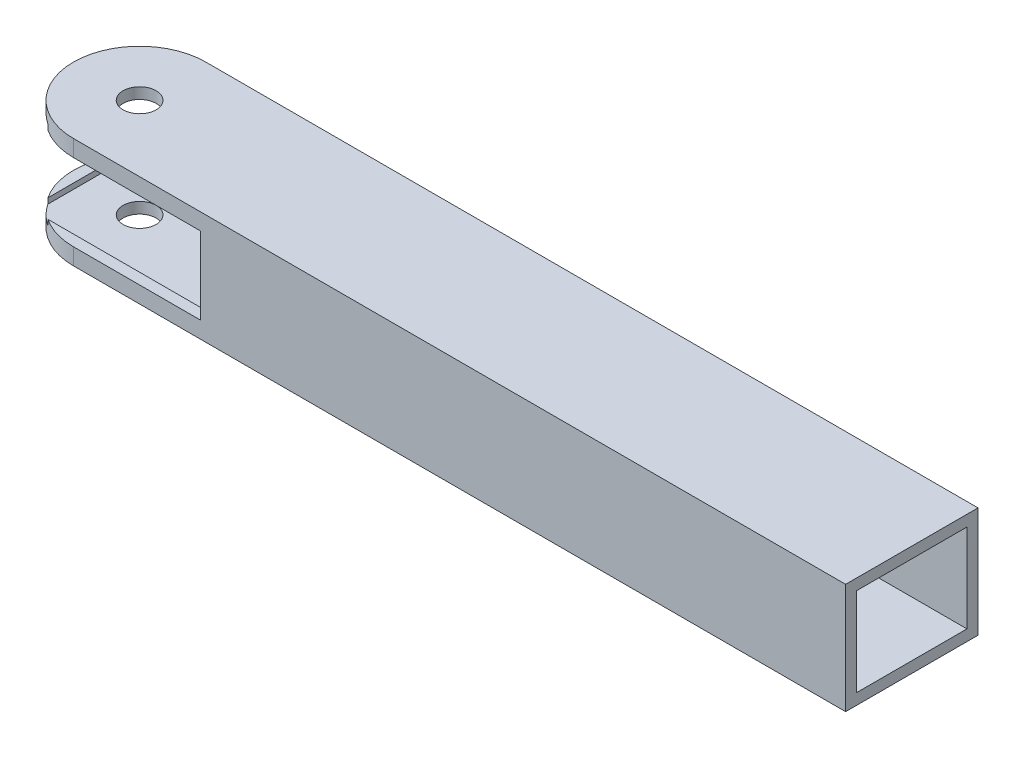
ISO-10303-21;
HEADER;
FILE_DESCRIPTION(('STEP AP214'),'2;1');
FILE_NAME('part.step','',(''),(''),'','','');
FILE_SCHEMA(('AUTOMOTIVE_DESIGN { 1 0 10303 214 1 1 1 1 }'));
ENDSEC;
DATA;
#1=APPLICATION_CONTEXT('core data for automotive mechanical design processes');
#2=APPLICATION_PROTOCOL_DEFINITION('international standard','automotive_design',2000,#1);
#3=PRODUCT_CONTEXT('',#1,'mechanical');
#4=PRODUCT('Part','Part','',(#3));
#5=PRODUCT_RELATED_PRODUCT_CATEGORY('part','',(#4));
#6=PRODUCT_DEFINITION_FORMATION('','',#4);
#7=PRODUCT_DEFINITION_CONTEXT('part definition',#1,'design');
#8=PRODUCT_DEFINITION('design','',#6,#7);
#9=PRODUCT_DEFINITION_SHAPE('','',#8);
#10=(LENGTH_UNIT() NAMED_UNIT(*) SI_UNIT(.MILLI.,.METRE.));
#11=(NAMED_UNIT(*) PLANE_ANGLE_UNIT() SI_UNIT($,.RADIAN.));
#12=(NAMED_UNIT(*) SI_UNIT($,.STERADIAN.) SOLID_ANGLE_UNIT());
#13=UNCERTAINTY_MEASURE_WITH_UNIT(LENGTH_MEASURE(1.E-05),#10,'distance_accuracy_value','');
#14=(GEOMETRIC_REPRESENTATION_CONTEXT(3) GLOBAL_UNCERTAINTY_ASSIGNED_CONTEXT((#13)) GLOBAL_UNIT_ASSIGNED_CONTEXT((#10,
#11,#12)) REPRESENTATION_CONTEXT('',''));
#15=CARTESIAN_POINT('',(0.,0.,0.));
#16=DIRECTION('',(0.,0.,1.));
#17=DIRECTION('',(1.,0.,0.));
#18=AXIS2_PLACEMENT_3D('',#15,#16,#17);
#19=CARTESIAN_POINT('',(11.5,1.5,6.));
#20=DIRECTION('',(0.,-1.,0.));
#21=DIRECTION('',(0.,0.,-1.));
#22=AXIS2_PLACEMENT_3D('',#19,#20,#21);
#23=PLANE('',#22);
#24=CARTESIAN_POINT('',(0.,1.5,0.));
#25=DIRECTION('',(0.,-1.,0.));
#26=DIRECTION('',(0.,0.,-1.));
#27=AXIS2_PLACEMENT_3D('',#24,#25,#26);
#28=CIRCLE('',#27,6.);
#29=CARTESIAN_POINT('',(-3.3166247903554,1.5,-5.));
#30=VERTEX_POINT('',#29);
#31=CARTESIAN_POINT('',(0.,1.5,-6.));
#32=VERTEX_POINT('',#31);
#33=EDGE_CURVE('E322',#30,#32,#28,.T.);
#34=ORIENTED_EDGE('',*,*,#33,.F.);
#35=DIRECTION('',(1.,0.,0.));
#36=VECTOR('',#35,1.);
#37=CARTESIAN_POINT('',(11.5,1.5,-5.));
#38=LINE('',#37,#36);
#39=CARTESIAN_POINT('',(11.5,1.5,-5.));
#40=VERTEX_POINT('',#39);
#41=EDGE_CURVE('E243',#30,#40,#38,.T.);
#42=ORIENTED_EDGE('',*,*,#41,.T.);
#43=DIRECTION('',(0.,0.,-1.));
#44=VECTOR('',#43,1.);
#45=CARTESIAN_POINT('',(11.5,1.5,6.));
#46=LINE('',#45,#44);
#47=CARTESIAN_POINT('',(11.5,1.5,-6.));
#48=VERTEX_POINT('',#47);
#49=EDGE_CURVE('E313',#40,#48,#46,.T.);
#50=ORIENTED_EDGE('',*,*,#49,.T.);
#51=DIRECTION('',(-1.,0.,0.));
#52=VECTOR('',#51,1.);
#53=CARTESIAN_POINT('',(11.5,1.5,-6.));
#54=LINE('',#53,#52);
#55=EDGE_CURVE('E288',#48,#32,#54,.T.);
#56=ORIENTED_EDGE('',*,*,#55,.T.);
#57=EDGE_LOOP('',(#34,#42,#50,#56));
#58=FACE_BOUND('',#57,.T.);
#59=ADVANCED_FACE('F47',(#58),#23,.F.);
#60=DIRECTION('',(0.,0.,1.));
#61=VECTOR('',#60,1.);
#62=CARTESIAN_POINT('',(-4.99999999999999,1.5,6.));
#63=LINE('',#62,#61);
#64=CARTESIAN_POINT('',(-4.99999999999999,1.5,-3.31662479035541));
#65=VERTEX_POINT('',#64);
#66=CARTESIAN_POINT('',(-4.99999999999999,1.5,3.31662479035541));
#67=VERTEX_POINT('',#66);
#68=EDGE_CURVE('E261',#65,#67,#63,.T.);
#69=ORIENTED_EDGE('',*,*,#68,.F.);
#70=EDGE_CURVE('E329',#67,#65,#28,.T.);
#71=ORIENTED_EDGE('',*,*,#70,.F.);
#72=EDGE_LOOP('',(#69,#71));
#73=FACE_BOUND('',#72,.T.);
#74=ADVANCED_FACE('F538',(#73),#23,.F.);
#75=CARTESIAN_POINT('',(11.5,8.5,6.));
#76=DIRECTION('',(0.,1.,0.));
#77=DIRECTION('',(0.,0.,1.));
#78=AXIS2_PLACEMENT_3D('',#75,#76,#77);
#79=PLANE('',#78);
#80=DIRECTION('',(0.,0.,-1.));
#81=VECTOR('',#80,1.);
#82=CARTESIAN_POINT('',(11.5,8.5,6.));
#83=LINE('',#82,#81);
#84=CARTESIAN_POINT('',(11.5,8.5,-5.));
#85=VERTEX_POINT('',#84);
#86=CARTESIAN_POINT('',(11.5,8.5,-6.));
#87=VERTEX_POINT('',#86);
#88=EDGE_CURVE('E296',#85,#87,#83,.T.);
#89=ORIENTED_EDGE('',*,*,#88,.F.);
#90=DIRECTION('',(-1.,0.,0.));
#91=VECTOR('',#90,1.);
#92=CARTESIAN_POINT('',(11.5,8.5,-5.));
#93=LINE('',#92,#91);
#94=CARTESIAN_POINT('',(-3.3166247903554,8.5,-5.));
#95=VERTEX_POINT('',#94);
#96=EDGE_CURVE('E239',#85,#95,#93,.T.);
#97=ORIENTED_EDGE('',*,*,#96,.T.);
#98=CARTESIAN_POINT('',(0.,8.5,0.));
#99=DIRECTION('',(0.,1.,0.));
#100=DIRECTION('',(0.,0.,1.));
#101=AXIS2_PLACEMENT_3D('',#98,#99,#100);
#102=CIRCLE('',#101,6.);
#103=CARTESIAN_POINT('',(0.,8.5,-6.));
#104=VERTEX_POINT('',#103);
#105=EDGE_CURVE('E318',#104,#95,#102,.T.);
#106=ORIENTED_EDGE('',*,*,#105,.F.);
#107=DIRECTION('',(1.,0.,0.));
#108=VECTOR('',#107,1.);
#109=CARTESIAN_POINT('',(11.5,8.5,-6.));
#110=LINE('',#109,#108);
#111=EDGE_CURVE('E297',#104,#87,#110,.T.);
#112=ORIENTED_EDGE('',*,*,#111,.T.);
#113=EDGE_LOOP('',(#89,#97,#106,#112));
#114=FACE_BOUND('',#113,.T.);
#115=ADVANCED_FACE('F393',(#114),#79,.F.);
#116=DIRECTION('',(0.,0.,-1.));
#117=VECTOR('',#116,1.);
#118=CARTESIAN_POINT('',(-4.99999999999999,8.5,6.));
#119=LINE('',#118,#117);
#120=CARTESIAN_POINT('',(-4.99999999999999,8.5,3.31662479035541));
#121=VERTEX_POINT('',#120);
#122=CARTESIAN_POINT('',(-4.99999999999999,8.5,-3.31662479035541));
#123=VERTEX_POINT('',#122);
#124=EDGE_CURVE('E11',#121,#123,#119,.T.);
#125=ORIENTED_EDGE('',*,*,#124,.F.);
#126=EDGE_CURVE('E323',#123,#121,#102,.T.);
#127=ORIENTED_EDGE('',*,*,#126,.F.);
#128=EDGE_LOOP('',(#125,#127));
#129=FACE_BOUND('',#128,.T.);
#130=ADVANCED_FACE('F486',(#129),#79,.F.);
#131=CARTESIAN_POINT('',(11.5,8.5,6.));
#132=DIRECTION('',(1.,0.,0.));
#133=DIRECTION('',(0.,0.,-1.));
#134=AXIS2_PLACEMENT_3D('',#131,#132,#133);
#135=PLANE('',#134);
#136=ORIENTED_EDGE('',*,*,#49,.F.);
#137=DIRECTION('',(0.,1.,0.));
#138=VECTOR('',#137,1.);
#139=CARTESIAN_POINT('',(11.5,8.5,-5.));
#140=LINE('',#139,#138);
#141=EDGE_CURVE('E57',#40,#85,#140,.T.);
#142=ORIENTED_EDGE('',*,*,#141,.T.);
#143=ORIENTED_EDGE('',*,*,#88,.T.);
#144=DIRECTION('',(0.,-1.,0.));
#145=VECTOR('',#144,1.);
#146=CARTESIAN_POINT('',(11.5,8.5,-6.));
#147=LINE('',#146,#145);
#148=EDGE_CURVE('E301',#87,#48,#147,.T.);
#149=ORIENTED_EDGE('',*,*,#148,.T.);
#150=EDGE_LOOP('',(#136,#142,#143,#149));
#151=FACE_BOUND('',#150,.T.);
#152=ADVANCED_FACE('F391',(#151),#135,.F.);
#153=CARTESIAN_POINT('',(0.,10.,0.));
#154=DIRECTION('',(0.,-1.,0.));
#155=DIRECTION('',(0.,0.,-1.));
#156=AXIS2_PLACEMENT_3D('',#153,#154,#155);
#157=CYLINDRICAL_SURFACE('',#156,6.);
#158=CARTESIAN_POINT('',(0.,1.5,6.));
#159=VERTEX_POINT('',#158);
#160=CARTESIAN_POINT('',(-3.3166247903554,1.5,5.));
#161=VERTEX_POINT('',#160);
#162=EDGE_CURVE('E324',#159,#161,#28,.T.);
#163=ORIENTED_EDGE('',*,*,#162,.T.);
#164=DIRECTION('',(0.,-1.,0.));
#165=VECTOR('',#164,1.);
#166=CARTESIAN_POINT('',(-3.3166247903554,10.,5.));
#167=LINE('',#166,#165);
#168=CARTESIAN_POINT('',(-3.3166247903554,1.,5.));
#169=VERTEX_POINT('',#168);
#170=EDGE_CURVE('E235',#161,#169,#167,.T.);
#171=ORIENTED_EDGE('',*,*,#170,.T.);
#172=CARTESIAN_POINT('',(0.,0.999999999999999,0.));
#173=DIRECTION('',(0.,-1.,0.));
#174=DIRECTION('',(0.,0.,-1.));
#175=AXIS2_PLACEMENT_3D('',#172,#173,#174);
#176=CIRCLE('',#175,6.);
#177=CARTESIAN_POINT('',(-4.99999999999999,1.,3.31662479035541));
#178=VERTEX_POINT('',#177);
#179=EDGE_CURVE('E282',#169,#178,#176,.T.);
#180=ORIENTED_EDGE('',*,*,#179,.T.);
#181=DIRECTION('',(0.,-1.,0.));
#182=VECTOR('',#181,1.);
#183=CARTESIAN_POINT('',(-4.99999999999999,10.,3.31662479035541));
#184=LINE('',#183,#182);
#185=EDGE_CURVE('E267',#67,#178,#184,.T.);
#186=ORIENTED_EDGE('',*,*,#185,.F.);
#187=ORIENTED_EDGE('',*,*,#70,.T.);
#188=DIRECTION('',(0.,-1.,0.));
#189=VECTOR('',#188,1.);
#190=CARTESIAN_POINT('',(-4.99999999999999,10.,-3.31662479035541));
#191=LINE('',#190,#189);
#192=CARTESIAN_POINT('',(-4.99999999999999,1.,-3.31662479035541));
#193=VERTEX_POINT('',#192);
#194=EDGE_CURVE('E264',#193,#65,#191,.F.);
#195=ORIENTED_EDGE('',*,*,#194,.F.);
#196=CARTESIAN_POINT('',(-3.3166247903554,0.999999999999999,-5.));
#197=VERTEX_POINT('',#196);
#198=EDGE_CURVE('E278',#193,#197,#176,.T.);
#199=ORIENTED_EDGE('',*,*,#198,.T.);
#200=DIRECTION('',(0.,-1.,0.));
#201=VECTOR('',#200,1.);
#202=CARTESIAN_POINT('',(-3.3166247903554,10.,-5.));
#203=LINE('',#202,#201);
#204=EDGE_CURVE('E251',#197,#30,#203,.F.);
#205=ORIENTED_EDGE('',*,*,#204,.T.);
#206=ORIENTED_EDGE('',*,*,#33,.T.);
#207=DIRECTION('',(0.,-1.,0.));
#208=VECTOR('',#207,1.);
#209=CARTESIAN_POINT('',(0.,10.,-6.));
#210=LINE('',#209,#208);
#211=CARTESIAN_POINT('',(0.,0.,-6.));
#212=VERTEX_POINT('',#211);
#213=EDGE_CURVE('E351',#32,#212,#210,.T.);
#214=ORIENTED_EDGE('',*,*,#213,.T.);
#215=CARTESIAN_POINT('',(0.,0.,0.));
#216=DIRECTION('',(0.,1.,0.));
#217=DIRECTION('',(0.,0.,1.));
#218=AXIS2_PLACEMENT_3D('',#215,#216,#217);
#219=CIRCLE('',#218,6.);
#220=CARTESIAN_POINT('',(0.,0.,6.));
#221=VERTEX_POINT('',#220);
#222=EDGE_CURVE('E334',#212,#221,#219,.T.);
#223=ORIENTED_EDGE('',*,*,#222,.T.);
#224=DIRECTION('',(0.,-1.,0.));
#225=VECTOR('',#224,1.);
#226=CARTESIAN_POINT('',(0.,10.,6.));
#227=LINE('',#226,#225);
#228=EDGE_CURVE('E376',#159,#221,#227,.T.);
#229=ORIENTED_EDGE('',*,*,#228,.F.);
#230=EDGE_LOOP('',(#163,#171,#180,#186,#187,#195,#199,#205,#206,#214,#223,#229));
#231=FACE_BOUND('',#230,.T.);
#232=ADVANCED_FACE('F503',(#231),#157,.T.);
#233=CARTESIAN_POINT('',(0.,10.,0.));
#234=DIRECTION('',(0.,-1.,0.));
#235=DIRECTION('',(0.,0.,-1.));
#236=AXIS2_PLACEMENT_3D('',#233,#234,#235);
#237=CYLINDRICAL_SURFACE('',#236,1.5);
#238=CARTESIAN_POINT('',(0.,0.999999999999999,0.));
#239=DIRECTION('',(0.,-1.,0.));
#240=DIRECTION('',(0.,0.,-1.));
#241=AXIS2_PLACEMENT_3D('',#238,#239,#240);
#242=CIRCLE('',#241,1.5);
#243=CARTESIAN_POINT('',(0.,0.999999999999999,-1.5));
#244=VERTEX_POINT('',#243);
#245=EDGE_CURVE('E274',#244,#244,#242,.T.);
#246=ORIENTED_EDGE('',*,*,#245,.F.);
#247=EDGE_LOOP('',(#246));
#248=FACE_BOUND('',#247,.T.);
#249=CARTESIAN_POINT('',(0.,0.,0.));
#250=DIRECTION('',(0.,1.,0.));
#251=DIRECTION('',(0.,0.,1.));
#252=AXIS2_PLACEMENT_3D('',#249,#250,#251);
#253=CIRCLE('',#252,1.5);
#254=CARTESIAN_POINT('',(0.,0.,1.5));
#255=VERTEX_POINT('',#254);
#256=EDGE_CURVE('E328',#255,#255,#253,.T.);
#257=ORIENTED_EDGE('',*,*,#256,.F.);
#258=EDGE_LOOP('',(#257));
#259=FACE_BOUND('',#258,.T.);
#260=ADVANCED_FACE('F557',(#248,#259),#237,.F.);
#261=CARTESIAN_POINT('',(0.,10.,0.));
#262=DIRECTION('',(0.,1.,0.));
#263=DIRECTION('',(0.,0.,1.));
#264=AXIS2_PLACEMENT_3D('',#261,#262,#263);
#265=PLANE('',#264);
#266=CARTESIAN_POINT('',(0.,10.,0.));
#267=DIRECTION('',(0.,1.,0.));
#268=DIRECTION('',(0.,0.,1.));
#269=AXIS2_PLACEMENT_3D('',#266,#267,#268);
#270=CIRCLE('',#269,6.);
#271=CARTESIAN_POINT('',(0.,10.,-6.));
#272=VERTEX_POINT('',#271);
#273=CARTESIAN_POINT('',(0.,10.,6.));
#274=VERTEX_POINT('',#273);
#275=EDGE_CURVE('E338',#272,#274,#270,.T.);
#276=ORIENTED_EDGE('',*,*,#275,.T.);
#277=DIRECTION('',(1.,0.,0.));
#278=VECTOR('',#277,1.);
#279=CARTESIAN_POINT('',(0.,10.,6.));
#280=LINE('',#279,#278);
#281=CARTESIAN_POINT('',(70.,10.,6.));
#282=VERTEX_POINT('',#281);
#283=EDGE_CURVE('E341',#274,#282,#280,.T.);
#284=ORIENTED_EDGE('',*,*,#283,.T.);
#285=DIRECTION('',(0.,0.,-1.));
#286=VECTOR('',#285,1.);
#287=CARTESIAN_POINT('',(70.,10.,-6.));
#288=LINE('',#287,#286);
#289=CARTESIAN_POINT('',(70.,10.,-6.));
#290=VERTEX_POINT('',#289);
#291=EDGE_CURVE('E345',#282,#290,#288,.T.);
#292=ORIENTED_EDGE('',*,*,#291,.T.);
#293=DIRECTION('',(-1.,0.,0.));
#294=VECTOR('',#293,1.);
#295=CARTESIAN_POINT('',(0.,10.,-6.));
#296=LINE('',#295,#294);
#297=EDGE_CURVE('E348',#290,#272,#296,.T.);
#298=ORIENTED_EDGE('',*,*,#297,.T.);
#299=EDGE_LOOP('',(#276,#284,#292,#298));
#300=FACE_BOUND('',#299,.T.);
#301=CARTESIAN_POINT('',(0.,10.,0.));
#302=DIRECTION('',(0.,1.,0.));
#303=DIRECTION('',(0.,0.,1.));
#304=AXIS2_PLACEMENT_3D('',#301,#302,#303);
#305=CIRCLE('',#304,1.5);
#306=CARTESIAN_POINT('',(0.,10.,1.5));
#307=VERTEX_POINT('',#306);
#308=EDGE_CURVE('E330',#307,#307,#305,.T.);
#309=ORIENTED_EDGE('',*,*,#308,.F.);
#310=EDGE_LOOP('',(#309));
#311=FACE_BOUND('',#310,.T.);
#312=ADVANCED_FACE('F516',(#300,#311),#265,.T.);
#313=CARTESIAN_POINT('',(0.,0.,0.));
#314=DIRECTION('',(0.,1.,0.));
#315=DIRECTION('',(0.,0.,1.));
#316=AXIS2_PLACEMENT_3D('',#313,#314,#315);
#317=PLANE('',#316);
#318=ORIENTED_EDGE('',*,*,#222,.F.);
#319=DIRECTION('',(-1.,0.,0.));
#320=VECTOR('',#319,1.);
#321=CARTESIAN_POINT('',(0.,0.,-6.));
#322=LINE('',#321,#320);
#323=CARTESIAN_POINT('',(70.,0.,-6.));
#324=VERTEX_POINT('',#323);
#325=EDGE_CURVE('E342',#324,#212,#322,.T.);
#326=ORIENTED_EDGE('',*,*,#325,.F.);
#327=DIRECTION('',(0.,0.,-1.));
#328=VECTOR('',#327,1.);
#329=CARTESIAN_POINT('',(70.,0.,-6.));
#330=LINE('',#329,#328);
#331=CARTESIAN_POINT('',(70.,0.,6.));
#332=VERTEX_POINT('',#331);
#333=EDGE_CURVE('E358',#332,#324,#330,.T.);
#334=ORIENTED_EDGE('',*,*,#333,.F.);
#335=DIRECTION('',(1.,0.,0.));
#336=VECTOR('',#335,1.);
#337=CARTESIAN_POINT('',(0.,0.,6.));
#338=LINE('',#337,#336);
#339=EDGE_CURVE('E355',#221,#332,#338,.T.);
#340=ORIENTED_EDGE('',*,*,#339,.F.);
#341=EDGE_LOOP('',(#318,#326,#334,#340));
#342=FACE_BOUND('',#341,.T.);
#343=ORIENTED_EDGE('',*,*,#256,.T.);
#344=EDGE_LOOP('',(#343));
#345=FACE_BOUND('',#344,.T.);
#346=ADVANCED_FACE('F500',(#342,#345),#317,.F.);
#347=CARTESIAN_POINT('',(0.,9.,0.));
#348=DIRECTION('',(0.,1.,0.));
#349=DIRECTION('',(0.,0.,1.));
#350=AXIS2_PLACEMENT_3D('',#347,#348,#349);
#351=CIRCLE('',#350,6.);
#352=CARTESIAN_POINT('',(-4.99999999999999,9.,3.31662479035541));
#353=VERTEX_POINT('',#352);
#354=CARTESIAN_POINT('',(-3.3166247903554,9.,5.));
#355=VERTEX_POINT('',#354);
#356=EDGE_CURVE('E270',#353,#355,#351,.T.);
#357=ORIENTED_EDGE('',*,*,#356,.T.);
#358=DIRECTION('',(0.,-1.,0.));
#359=VECTOR('',#358,1.);
#360=CARTESIAN_POINT('',(-3.3166247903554,10.,5.));
#361=LINE('',#360,#359);
#362=CARTESIAN_POINT('',(-3.3166247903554,8.5,5.));
#363=VERTEX_POINT('',#362);
#364=EDGE_CURVE('E193',#355,#363,#361,.T.);
#365=ORIENTED_EDGE('',*,*,#364,.T.);
#366=CARTESIAN_POINT('',(0.,8.5,6.));
#367=VERTEX_POINT('',#366);
#368=EDGE_CURVE('E312',#363,#367,#102,.T.);
#369=ORIENTED_EDGE('',*,*,#368,.T.);
#370=EDGE_CURVE('E377',#274,#367,#227,.T.);
#371=ORIENTED_EDGE('',*,*,#370,.F.);
#372=ORIENTED_EDGE('',*,*,#275,.F.);
#373=EDGE_CURVE('E364',#272,#104,#210,.T.);
#374=ORIENTED_EDGE('',*,*,#373,.T.);
#375=ORIENTED_EDGE('',*,*,#105,.T.);
#376=DIRECTION('',(0.,-1.,0.));
#377=VECTOR('',#376,1.);
#378=CARTESIAN_POINT('',(-3.3166247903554,10.,-5.));
#379=LINE('',#378,#377);
#380=CARTESIAN_POINT('',(-3.3166247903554,9.,-5.));
#381=VERTEX_POINT('',#380);
#382=EDGE_CURVE('E247',#95,#381,#379,.F.);
#383=ORIENTED_EDGE('',*,*,#382,.T.);
#384=CARTESIAN_POINT('',(-4.99999999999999,9.,-3.31662479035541));
#385=VERTEX_POINT('',#384);
#386=EDGE_CURVE('E273',#381,#385,#351,.T.);
#387=ORIENTED_EDGE('',*,*,#386,.T.);
#388=DIRECTION('',(0.,-1.,0.));
#389=VECTOR('',#388,1.);
#390=CARTESIAN_POINT('',(-4.99999999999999,10.,-3.31662479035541));
#391=LINE('',#390,#389);
#392=EDGE_CURVE('E255',#123,#385,#391,.F.);
#393=ORIENTED_EDGE('',*,*,#392,.F.);
#394=ORIENTED_EDGE('',*,*,#126,.T.);
#395=DIRECTION('',(0.,-1.,0.));
#396=VECTOR('',#395,1.);
#397=CARTESIAN_POINT('',(-4.99999999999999,10.,3.31662479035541));
#398=LINE('',#397,#396);
#399=EDGE_CURVE('E258',#353,#121,#398,.T.);
#400=ORIENTED_EDGE('',*,*,#399,.F.);
#401=EDGE_LOOP('',(#357,#365,#369,#371,#372,#374,#375,#383,#387,#393,#394,#400));
#402=FACE_BOUND('',#401,.T.);
#403=ADVANCED_FACE('F49',(#402),#157,.T.);
#404=CARTESIAN_POINT('',(0.,10.,6.));
#405=DIRECTION('',(0.,0.,-1.));
#406=DIRECTION('',(-1.,0.,0.));
#407=AXIS2_PLACEMENT_3D('',#404,#405,#406);
#408=PLANE('',#407);
#409=DIRECTION('',(0.,-1.,0.));
#410=VECTOR('',#409,1.);
#411=CARTESIAN_POINT('',(11.5,8.5,6.));
#412=LINE('',#411,#410);
#413=CARTESIAN_POINT('',(11.5,8.5,6.));
#414=VERTEX_POINT('',#413);
#415=CARTESIAN_POINT('',(11.5,1.5,6.));
#416=VERTEX_POINT('',#415);
#417=EDGE_CURVE('E287',#414,#416,#412,.T.);
#418=ORIENTED_EDGE('',*,*,#417,.T.);
#419=DIRECTION('',(-1.,0.,0.));
#420=VECTOR('',#419,1.);
#421=CARTESIAN_POINT('',(11.5,1.5,6.));
#422=LINE('',#421,#420);
#423=EDGE_CURVE('E292',#416,#159,#422,.T.);
#424=ORIENTED_EDGE('',*,*,#423,.T.);
#425=ORIENTED_EDGE('',*,*,#228,.T.);
#426=ORIENTED_EDGE('',*,*,#339,.T.);
#427=DIRECTION('',(0.,-1.,0.));
#428=VECTOR('',#427,1.);
#429=CARTESIAN_POINT('',(70.,10.,6.));
#430=LINE('',#429,#428);
#431=EDGE_CURVE('E372',#282,#332,#430,.T.);
#432=ORIENTED_EDGE('',*,*,#431,.F.);
#433=ORIENTED_EDGE('',*,*,#283,.F.);
#434=ORIENTED_EDGE('',*,*,#370,.T.);
#435=DIRECTION('',(1.,0.,0.));
#436=VECTOR('',#435,1.);
#437=CARTESIAN_POINT('',(11.5,8.5,6.));
#438=LINE('',#437,#436);
#439=EDGE_CURVE('E283',#367,#414,#438,.T.);
#440=ORIENTED_EDGE('',*,*,#439,.T.);
#441=EDGE_LOOP('',(#418,#424,#425,#426,#432,#433,#434,#440));
#442=FACE_BOUND('',#441,.T.);
#443=ADVANCED_FACE('F493',(#442),#408,.F.);
#444=CARTESIAN_POINT('',(70.,10.,-6.));
#445=DIRECTION('',(-1.,0.,0.));
#446=DIRECTION('',(0.,0.,1.));
#447=AXIS2_PLACEMENT_3D('',#444,#445,#446);
#448=PLANE('',#447);
#449=DIRECTION('',(0.,0.,1.));
#450=VECTOR('',#449,1.);
#451=CARTESIAN_POINT('',(70.,9.,-5.));
#452=LINE('',#451,#450);
#453=CARTESIAN_POINT('',(70.,9.,-5.));
#454=VERTEX_POINT('',#453);
#455=CARTESIAN_POINT('',(70.,9.,5.));
#456=VERTEX_POINT('',#455);
#457=EDGE_CURVE('E201',#454,#456,#452,.T.);
#458=ORIENTED_EDGE('',*,*,#457,.F.);
#459=DIRECTION('',(0.,1.,0.));
#460=VECTOR('',#459,1.);
#461=CARTESIAN_POINT('',(70.,1.,-5.));
#462=LINE('',#461,#460);
#463=CARTESIAN_POINT('',(70.,1.,-5.));
#464=VERTEX_POINT('',#463);
#465=EDGE_CURVE('E64',#464,#454,#462,.T.);
#466=ORIENTED_EDGE('',*,*,#465,.F.);
#467=DIRECTION('',(0.,0.,-1.));
#468=VECTOR('',#467,1.);
#469=CARTESIAN_POINT('',(70.,1.,5.));
#470=LINE('',#469,#468);
#471=CARTESIAN_POINT('',(70.,1.,5.));
#472=VERTEX_POINT('',#471);
#473=EDGE_CURVE('E209',#472,#464,#470,.T.);
#474=ORIENTED_EDGE('',*,*,#473,.F.);
#475=DIRECTION('',(0.,-1.,0.));
#476=VECTOR('',#475,1.);
#477=CARTESIAN_POINT('',(70.,9.,5.));
#478=LINE('',#477,#476);
#479=EDGE_CURVE('E190',#456,#472,#478,.T.);
#480=ORIENTED_EDGE('',*,*,#479,.F.);
#481=EDGE_LOOP('',(#458,#466,#474,#480));
#482=FACE_BOUND('',#481,.T.);
#483=ORIENTED_EDGE('',*,*,#333,.T.);
#484=DIRECTION('',(0.,-1.,0.));
#485=VECTOR('',#484,1.);
#486=CARTESIAN_POINT('',(70.,10.,-6.));
#487=LINE('',#486,#485);
#488=EDGE_CURVE('E368',#290,#324,#487,.T.);
#489=ORIENTED_EDGE('',*,*,#488,.F.);
#490=ORIENTED_EDGE('',*,*,#291,.F.);
#491=ORIENTED_EDGE('',*,*,#431,.T.);
#492=EDGE_LOOP('',(#483,#489,#490,#491));
#493=FACE_BOUND('',#492,.T.);
#494=ADVANCED_FACE('F206',(#482,#493),#448,.F.);
#495=CARTESIAN_POINT('',(0.,10.,-6.));
#496=DIRECTION('',(0.,0.,1.));
#497=DIRECTION('',(1.,0.,0.));
#498=AXIS2_PLACEMENT_3D('',#495,#496,#497);
#499=PLANE('',#498);
#500=ORIENTED_EDGE('',*,*,#213,.F.);
#501=ORIENTED_EDGE('',*,*,#55,.F.);
#502=ORIENTED_EDGE('',*,*,#148,.F.);
#503=ORIENTED_EDGE('',*,*,#111,.F.);
#504=ORIENTED_EDGE('',*,*,#373,.F.);
#505=ORIENTED_EDGE('',*,*,#297,.F.);
#506=ORIENTED_EDGE('',*,*,#488,.T.);
#507=ORIENTED_EDGE('',*,*,#325,.T.);
#508=EDGE_LOOP('',(#500,#501,#502,#503,#504,#505,#506,#507));
#509=FACE_BOUND('',#508,.T.);
#510=ADVANCED_FACE('F508',(#509),#499,.F.);
#511=CARTESIAN_POINT('',(0.,9.,0.));
#512=DIRECTION('',(0.,1.,0.));
#513=DIRECTION('',(0.,0.,1.));
#514=AXIS2_PLACEMENT_3D('',#511,#512,#513);
#515=CIRCLE('',#514,1.5);
#516=CARTESIAN_POINT('',(0.,9.,1.5));
#517=VERTEX_POINT('',#516);
#518=EDGE_CURVE('E51',#517,#517,#515,.T.);
#519=ORIENTED_EDGE('',*,*,#518,.F.);
#520=EDGE_LOOP('',(#519));
#521=FACE_BOUND('',#520,.T.);
#522=ORIENTED_EDGE('',*,*,#308,.T.);
#523=EDGE_LOOP('',(#522));
#524=FACE_BOUND('',#523,.T.);
#525=ADVANCED_FACE('F550',(#521,#524),#237,.F.);
#526=CARTESIAN_POINT('',(11.5,1.5,5.));
#527=VERTEX_POINT('',#526);
#528=EDGE_CURVE('E308',#416,#527,#46,.T.);
#529=ORIENTED_EDGE('',*,*,#528,.T.);
#530=DIRECTION('',(-1.,0.,0.));
#531=VECTOR('',#530,1.);
#532=CARTESIAN_POINT('',(11.5,1.5,5.));
#533=LINE('',#532,#531);
#534=EDGE_CURVE('E72',#527,#161,#533,.T.);
#535=ORIENTED_EDGE('',*,*,#534,.T.);
#536=ORIENTED_EDGE('',*,*,#162,.F.);
#537=ORIENTED_EDGE('',*,*,#423,.F.);
#538=EDGE_LOOP('',(#529,#535,#536,#537));
#539=FACE_BOUND('',#538,.T.);
#540=ADVANCED_FACE('F526',(#539),#23,.F.);
#541=ORIENTED_EDGE('',*,*,#368,.F.);
#542=DIRECTION('',(1.,0.,0.));
#543=VECTOR('',#542,1.);
#544=CARTESIAN_POINT('',(11.5,8.5,5.));
#545=LINE('',#544,#543);
#546=CARTESIAN_POINT('',(11.5,8.5,5.));
#547=VERTEX_POINT('',#546);
#548=EDGE_CURVE('E223',#363,#547,#545,.T.);
#549=ORIENTED_EDGE('',*,*,#548,.T.);
#550=EDGE_CURVE('E314',#414,#547,#83,.T.);
#551=ORIENTED_EDGE('',*,*,#550,.F.);
#552=ORIENTED_EDGE('',*,*,#439,.F.);
#553=EDGE_LOOP('',(#541,#549,#551,#552));
#554=FACE_BOUND('',#553,.T.);
#555=ADVANCED_FACE('F521',(#554),#79,.F.);
#556=ORIENTED_EDGE('',*,*,#550,.T.);
#557=DIRECTION('',(0.,-1.,0.));
#558=VECTOR('',#557,1.);
#559=CARTESIAN_POINT('',(11.5,8.5,5.));
#560=LINE('',#559,#558);
#561=EDGE_CURVE('E381',#547,#527,#560,.T.);
#562=ORIENTED_EDGE('',*,*,#561,.T.);
#563=ORIENTED_EDGE('',*,*,#528,.F.);
#564=ORIENTED_EDGE('',*,*,#417,.F.);
#565=EDGE_LOOP('',(#556,#562,#563,#564));
#566=FACE_BOUND('',#565,.T.);
#567=ADVANCED_FACE('F524',(#566),#135,.F.);
#568=CARTESIAN_POINT('',(-4.99999999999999,1.,5.));
#569=DIRECTION('',(0.,-1.,0.));
#570=DIRECTION('',(0.,0.,-1.));
#571=AXIS2_PLACEMENT_3D('',#568,#569,#570);
#572=PLANE('',#571);
#573=ORIENTED_EDGE('',*,*,#245,.T.);
#574=EDGE_LOOP('',(#573));
#575=FACE_BOUND('',#574,.T.);
#576=DIRECTION('',(1.,0.,0.));
#577=VECTOR('',#576,1.);
#578=CARTESIAN_POINT('',(-4.99999999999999,1.,5.));
#579=LINE('',#578,#577);
#580=EDGE_CURVE('E197',#169,#472,#579,.T.);
#581=ORIENTED_EDGE('',*,*,#580,.T.);
#582=ORIENTED_EDGE('',*,*,#473,.T.);
#583=DIRECTION('',(1.,0.,0.));
#584=VECTOR('',#583,1.);
#585=CARTESIAN_POINT('',(-4.99999999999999,1.,-5.));
#586=LINE('',#585,#584);
#587=EDGE_CURVE('E220',#197,#464,#586,.T.);
#588=ORIENTED_EDGE('',*,*,#587,.F.);
#589=ORIENTED_EDGE('',*,*,#198,.F.);
#590=DIRECTION('',(0.,0.,-1.));
#591=VECTOR('',#590,1.);
#592=CARTESIAN_POINT('',(-4.99999999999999,1.,5.));
#593=LINE('',#592,#591);
#594=EDGE_CURVE('E228',#178,#193,#593,.T.);
#595=ORIENTED_EDGE('',*,*,#594,.F.);
#596=ORIENTED_EDGE('',*,*,#179,.F.);
#597=EDGE_LOOP('',(#581,#582,#588,#589,#595,#596));
#598=FACE_BOUND('',#597,.T.);
#599=ADVANCED_FACE('F529',(#575,#598),#572,.F.);
#600=CARTESIAN_POINT('',(-4.99999999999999,9.,-5.));
#601=DIRECTION('',(0.,1.,0.));
#602=DIRECTION('',(0.,0.,1.));
#603=AXIS2_PLACEMENT_3D('',#600,#601,#602);
#604=PLANE('',#603);
#605=ORIENTED_EDGE('',*,*,#518,.T.);
#606=EDGE_LOOP('',(#605));
#607=FACE_BOUND('',#606,.T.);
#608=DIRECTION('',(1.,0.,0.));
#609=VECTOR('',#608,1.);
#610=CARTESIAN_POINT('',(-4.99999999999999,9.,-5.));
#611=LINE('',#610,#609);
#612=EDGE_CURVE('E198',#381,#454,#611,.T.);
#613=ORIENTED_EDGE('',*,*,#612,.T.);
#614=ORIENTED_EDGE('',*,*,#457,.T.);
#615=DIRECTION('',(1.,0.,0.));
#616=VECTOR('',#615,1.);
#617=CARTESIAN_POINT('',(-4.99999999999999,9.,5.));
#618=LINE('',#617,#616);
#619=EDGE_CURVE('E185',#355,#456,#618,.T.);
#620=ORIENTED_EDGE('',*,*,#619,.F.);
#621=ORIENTED_EDGE('',*,*,#356,.F.);
#622=DIRECTION('',(0.,0.,1.));
#623=VECTOR('',#622,1.);
#624=CARTESIAN_POINT('',(-4.99999999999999,9.,-5.));
#625=LINE('',#624,#623);
#626=EDGE_CURVE('E216',#385,#353,#625,.T.);
#627=ORIENTED_EDGE('',*,*,#626,.F.);
#628=ORIENTED_EDGE('',*,*,#386,.F.);
#629=EDGE_LOOP('',(#613,#614,#620,#621,#627,#628));
#630=FACE_BOUND('',#629,.T.);
#631=ADVANCED_FACE('F202',(#607,#630),#604,.F.);
#632=CARTESIAN_POINT('',(-4.99999999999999,0.,0.));
#633=DIRECTION('',(1.,0.,0.));
#634=DIRECTION('',(0.,0.,-1.));
#635=AXIS2_PLACEMENT_3D('',#632,#633,#634);
#636=PLANE('',#635);
#637=ORIENTED_EDGE('',*,*,#185,.T.);
#638=ORIENTED_EDGE('',*,*,#594,.T.);
#639=ORIENTED_EDGE('',*,*,#194,.T.);
#640=ORIENTED_EDGE('',*,*,#68,.T.);
#641=EDGE_LOOP('',(#637,#638,#639,#640));
#642=FACE_BOUND('',#641,.T.);
#643=ADVANCED_FACE('F534',(#642),#636,.T.);
#644=ORIENTED_EDGE('',*,*,#399,.T.);
#645=ORIENTED_EDGE('',*,*,#124,.T.);
#646=ORIENTED_EDGE('',*,*,#392,.T.);
#647=ORIENTED_EDGE('',*,*,#626,.T.);
#648=EDGE_LOOP('',(#644,#645,#646,#647));
#649=FACE_BOUND('',#648,.T.);
#650=ADVANCED_FACE('F488',(#649),#636,.T.);
#651=CARTESIAN_POINT('',(-4.99999999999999,1.,-5.));
#652=DIRECTION('',(0.,0.,-1.));
#653=DIRECTION('',(-1.,0.,0.));
#654=AXIS2_PLACEMENT_3D('',#651,#652,#653);
#655=PLANE('',#654);
#656=ORIENTED_EDGE('',*,*,#587,.T.);
#657=ORIENTED_EDGE('',*,*,#465,.T.);
#658=ORIENTED_EDGE('',*,*,#612,.F.);
#659=ORIENTED_EDGE('',*,*,#382,.F.);
#660=ORIENTED_EDGE('',*,*,#96,.F.);
#661=ORIENTED_EDGE('',*,*,#141,.F.);
#662=ORIENTED_EDGE('',*,*,#41,.F.);
#663=ORIENTED_EDGE('',*,*,#204,.F.);
#664=EDGE_LOOP('',(#656,#657,#658,#659,#660,#661,#662,#663));
#665=FACE_BOUND('',#664,.T.);
#666=ADVANCED_FACE('F640',(#665),#655,.F.);
#667=CARTESIAN_POINT('',(-4.99999999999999,9.,5.));
#668=DIRECTION('',(0.,0.,1.));
#669=DIRECTION('',(1.,0.,0.));
#670=AXIS2_PLACEMENT_3D('',#667,#668,#669);
#671=PLANE('',#670);
#672=ORIENTED_EDGE('',*,*,#534,.F.);
#673=ORIENTED_EDGE('',*,*,#561,.F.);
#674=ORIENTED_EDGE('',*,*,#548,.F.);
#675=ORIENTED_EDGE('',*,*,#364,.F.);
#676=ORIENTED_EDGE('',*,*,#619,.T.);
#677=ORIENTED_EDGE('',*,*,#479,.T.);
#678=ORIENTED_EDGE('',*,*,#580,.F.);
#679=ORIENTED_EDGE('',*,*,#170,.F.);
#680=EDGE_LOOP('',(#672,#673,#674,#675,#676,#677,#678,#679));
#681=FACE_BOUND('',#680,.T.);
#682=ADVANCED_FACE('F187',(#681),#671,.F.);
#683=CLOSED_SHELL('',(#59,#74,#115,#130,#152,#232,#260,#312,#346,#403,#443,#494,#510,#525,#540,
#555,#567,#599,#631,#643,#650,#666,#682));
#684=MANIFOLD_SOLID_BREP('B2',#683);
#685=ADVANCED_BREP_SHAPE_REPRESENTATION('',(#18,#684),#14);
#686=SHAPE_DEFINITION_REPRESENTATION(#9,#685);
ENDSEC;
END-ISO-10303-21;
